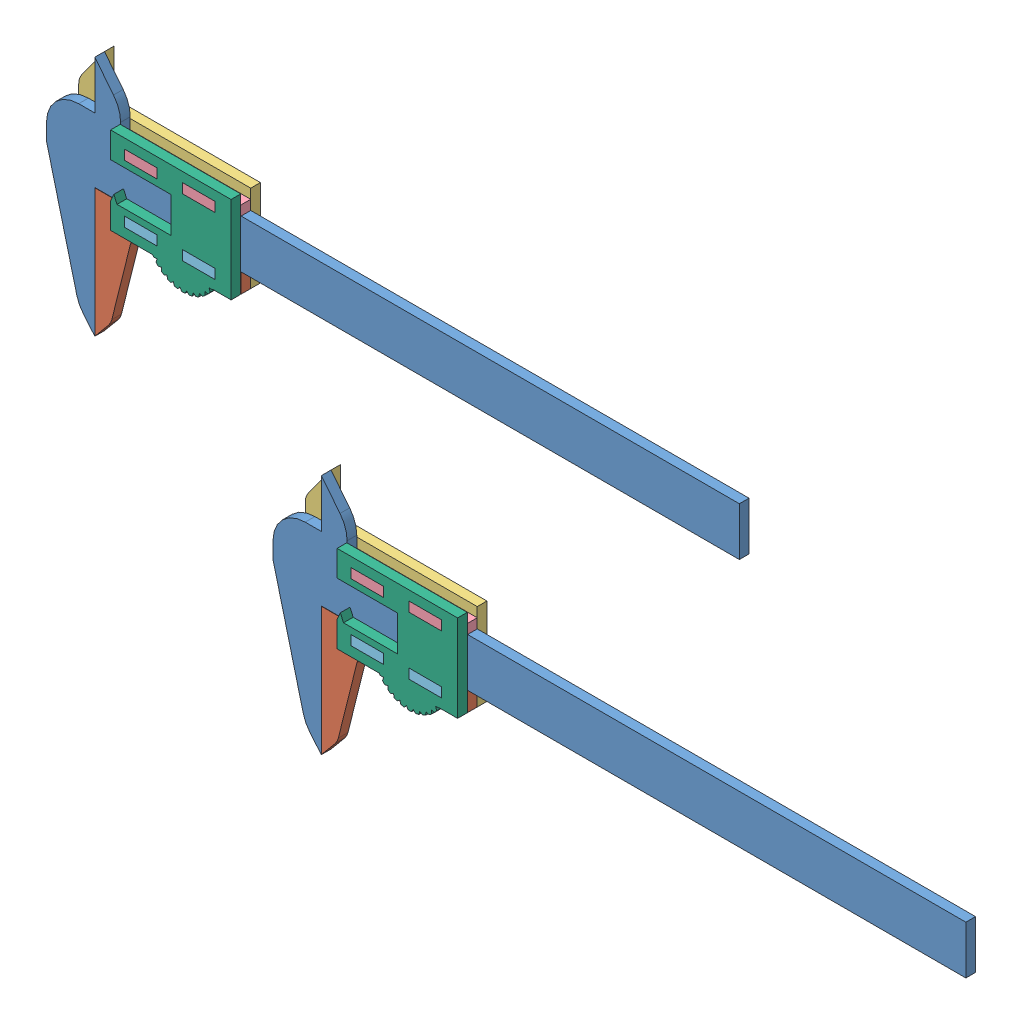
SolidWorks assembly Assemblage1.SLDASM, configuration Défaut (file format 7000). Lengths in mm.
Overall size (218.47 219.12 75.92).
12 component instances, 6 part files, 35 mates.
Components (placement in the parent):
- PIED-1: PIED.SLDPRT [Défaut] at (-102.9276 -4.2937 215) size (215 75 3)
- COULISSE-1: COULISSE.SLDPRT [Défaut] at (-102.9276 -4.2937 215) x (-1 0 0) z (0 0 -1) size (45.38 39.9 3)
- COULISSE 2-1: COULISSE 2.SLDPRT [Défaut] at (-102.9276 -4.2937 215) x (-1 0 0) z (0 0 -1) size (53.37 46.39 3)
- ERGOT-1: ERGOT.SLDPRT [Défaut] at (-102.9276 10.7063 215) x (-1 0 0) z (0 1 0) size (37.38 9.1 3)
- ERGOT2-1: ERGOT2.SLDPRT [Défaut] at (-102.9276 -4.2937 215) x (1 0 0) z (0 -1 0) size (28 9.1 3)
- FENETRE-1: FENETRE.SLDPRT [Défaut] at (-102.9276 10.7063 218.1) x (-1 0 0) z (0 0 1) size (37.38 32.39 3)
- PIED-2: PIED.SLDPRT [Défaut] at (-106.3932 139.8261 281.8181) size (215 75 3)
- FENETRE-2: FENETRE.SLDPRT [Défaut] at (-106.3932 154.8261 284.9181) x (-1 0 0) z (0 0 1) size (37.38 32.39 3)
- COULISSE-2: COULISSE.SLDPRT [Défaut] at (-106.3932 139.8261 281.8181) x (-1 0 0) z (0 0 -1) size (45.38 39.9 3)
- COULISSE 2-2: COULISSE 2.SLDPRT [Défaut] at (-106.3932 139.8261 281.8181) x (-1 0 0) z (0 0 -1) size (53.37 46.39 3)
- ERGOT2-2: ERGOT2.SLDPRT [Défaut] at (-106.3932 139.8261 281.8181) x (1 0 0) z (0 -1 0) size (28 9.1 3)
- ERGOT-3: ERGOT.SLDPRT [Défaut] at (-106.3932 154.8261 281.8181) x (-1 0 0) z (0 1 0) size (37.38 9.1 3)
Mates (geometry in assembly coordinates):
- Sur place1: in place: plane of PIED-1 through (-102.9276 -4.2937 215) normal (0 0 -1); plane of ? through (0 0 215) normal (0 0 -1); moOrthogonalPlaneRef_w of PIED-1 through (-102.9276 -4.2937 215) normal (0 0 -1); unknown of ?; plane of PIED-1 through (-102.9276 -4.2937 215) normal (0 0 -1); plane of ? through (0 0 215) normal (-1 0 0); plane of PIED-1 through (-102.9276 -4.2937 215) normal (0 0 -1); unknown of ?
- Coïncidente1: coincident aligned: plane of PIED-1; plane of COULISSE-1
- Coïncidente2: coincident aligned: moOrthogonalPlaneRef_w of PIED-1 through (-102.9276 -4.2937 215) normal (0 1 0); plane of COULISSE-1
- Coïncidente3: coincident anti-aligned: moOrthogonalPlaneRef_w of PIED-1 through (-102.9276 -4.2937 215) normal (1 0 0); plane of COULISSE-1 through (-102.9276 -4.2937 215) normal (-1 0 0)
- Sur place2: in place: plane of PIED-1 through (-102.9276 -4.2937 215) normal (0 0 -1); plane of ? through (0 0 215) normal (0 0 -1); plane of PIED-1 through (-102.9276 -4.2937 215) normal (0 0 -1); unknown of ?; plane of PIED-1 through (-102.9276 -4.2937 215) normal (0 0 -1); plane of ? through (0 0 215) normal (-1 0 0); plane of PIED-1 through (-102.9276 -4.2937 215) normal (0 0 -1); unknown of ?
- Coïncidente4: coincident aligned: plane of PIED-1; plane of COULISSE 2-1
- Coïncidente5: coincident aligned: moOrthogonalPlaneRef_w of PIED-1 through (-102.9276 -4.2937 215) normal (0 1 0); plane of COULISSE 2-1
- Coïncidente6: coincident anti-aligned: moOrthogonalPlaneRef_w of PIED-1 through (-102.9276 -4.2937 215) normal (1 0 0); plane of COULISSE 2-1 through (-102.9276 -4.2937 215) normal (-1 0 0)
- Sur place3: in place: plane of ? through (-72.249 10.7063 212) normal (0 1 0); plane of ? through (0 10.7063 0) normal (0 1 0); plane of ? through (-72.249 10.7063 212) normal (0 1 0); plane of ? through (0 10.7063 0) normal (0 0 -1); plane of ? through (-72.249 10.7063 212) normal (0 1 0); line of ? through (-55 0 10.7063) axis (0 1 0); plane of ? through (-72.5429 10.7063 212) normal (0 1 0); unknown of ERGOT-1
- Coïncidente7: coincident aligned: plane of COULISSE 2-1; plane of ERGOT-1
- Coïncidente8: coincident aligned: moOrthogonalPlaneRef_w of COULISSE 2-1 through (-102.9276 10.7063 215) normal (0 0 1); plane of ERGOT-1
- Coïncidente9: coincident anti-aligned: moOrthogonalPlaneRef_w of COULISSE 2-1 through (-102.9276 10.7063 215) normal (1 0 0); plane of ERGOT-1
- Sur place4: in place: plane of ? through (-90.7757 -4.2937 212) normal (0 -1 0); plane of ? through (0 -4.2937 0) normal (0 -1 0); plane of ? through (-90.7757 -4.2937 212) normal (0 -1 0); unknown of ?; plane of ? through (-90.7757 -4.2937 212) normal (0 -1 0); line of ? through (-55 0 -4.2937) axis (0 -1 0); plane of ? through (-90.5429 -4.2937 212) normal (0 -1 0); unknown of ERGOT2-1
- Coïncidente10: coincident aligned: plane of COULISSE 2-1; plane of ERGOT2-1
- Coïncidente11: coincident aligned: moOrthogonalPlaneRef_w of COULISSE 2-1 through (-102.9276 -4.2937 215) normal (0 0 1); plane of ERGOT2-1 through (-102.9276 -4.2937 215) normal (0 0 1)
- Coïncidente12: coincident anti-aligned: moOrthogonalPlaneRef_w of COULISSE 2-1 through (-102.9276 -4.2937 215) normal (-1 0 0); plane of ERGOT2-1
- Sur place5: in place: plane of ? through (-80.5429 13.9063 218.3) normal (0 0 1); plane of ? through (0 0 218.3) normal (0 0 1); plane of ? through (-80.5429 13.9063 218.3) normal (0 0 1); plane of ? through (0 0 218.3) normal (0 1 0); plane of ? through (-80.5429 13.9063 218.3) normal (0 0 1); plane of ? through (0 0 218.3) normal (1 0 0); plane of ERGOT-1 through (-80.5429 13.7063 218.1) normal (0 0 1); unknown of FENETRE-1
- Coïncidente13: coincident aligned: plane of ERGOT-1; plane of FENETRE-1
- Coïncidente14: coincident aligned: moOrthogonalPlaneRef_w of ERGOT-1 through (-102.9276 10.7063 218.1) normal (0 -1 0); plane of FENETRE-1
- Coïncidente15: coincident anti-aligned: moOrthogonalPlaneRef_w of ERGOT-1 through (-102.9276 10.7063 218.1) normal (1 0 0); plane of FENETRE-1
- Coïncidente16: coincident anti-aligned: plane of COULISSE 2-2 through (-76.0085 136.8261 278.8181) normal (0 1 0); plane of ERGOT2-2 through (-106.3932 136.8261 281.8181) normal (0 -1 0)
- Coïncidente17: coincident anti-aligned: plane of COULISSE 2-2 through (-66.0085 139.8261 278.8181) normal (-1 0 0); plane of ERGOT2-2 through (-66.0085 136.8261 287.9181) normal (1 0 0)
- Coïncidente18: coincident anti-aligned: plane of COULISSE 2-2 through (-106.3932 139.8261 281.8181) normal (0 0 1); plane of ERGOT2-2 through (-76.0085 136.8261 281.8181) normal (0 0 -1)
- Coïncidente19: coincident anti-aligned: plane of COULISSE-2 through (-106.3932 139.8261 281.8181) normal (0 0 -1); plane of COULISSE 2-2 through (-106.3932 139.8261 281.8181) normal (0 0 1)
- Coïncidente20: coincident anti-aligned: plane of COULISSE-2 through (-94.0085 139.8261 281.8181) normal (1 0 0); plane of ERGOT2-2 through (-94.0085 136.8261 278.8181) normal (-1 0 0)
- Coïncidente21: coincident anti-aligned: plane of COULISSE-2 through (-94.0085 136.8261 281.8181) normal (0 1 0); plane of ERGOT2-2 through (-106.3932 136.8261 281.8181) normal (0 -1 0)
- Coïncidente22: coincident aligned: plane of COULISSE 2-2 through (-106.3932 139.8261 278.8181) normal (0 0 -1); plane of ERGOT-3 through (-66.0085 157.8261 278.8181) normal (0 0 -1)
- Coïncidente23: coincident anti-aligned: plane of COULISSE 2-2 through (-66.0085 157.8261 278.8181) normal (-1 0 0); plane of ERGOT-3 through (-66.0085 157.8261 281.8181) normal (1 0 0)
- Coïncidente24: coincident anti-aligned: plane of COULISSE 2-2 through (-76.0085 154.8261 278.8181) normal (0 1 0); plane of ERGOT-3 through (-106.3932 154.8261 281.8181) normal (0 -1 0)
- Coïncidente25: coincident anti-aligned: plane of FENETRE-2 through (-106.3932 154.8261 284.9181) normal (0 0 -1); plane of ERGOT2-2 through (-84.0085 136.8261 284.9181) normal (0 0 1)
- Coïncidente26: coincident anti-aligned: plane of FENETRE-2 through (-76.0085 136.8261 287.9181) normal (1 0 0); plane of ERGOT2-2 through (-76.0085 136.8261 284.9181) normal (-1 0 0)
- Coïncidente27: coincident anti-aligned: plane of FENETRE-2 through (-66.0085 136.8261 287.9181) normal (0 1 0); plane of ERGOT2-2 through (-106.3932 136.8261 281.8181) normal (0 -1 0)
- Coïncidente28: coincident anti-aligned: plane of PIED-2 through (-106.3932 139.8261 281.8181) normal (0 0 -1); plane of COULISSE 2-2 through (-106.3932 139.8261 281.8181) normal (0 0 1)
- Coïncidente29: coincident anti-aligned: plane of PIED-2 through (-106.3932 139.8261 284.8181) normal (0 -1 0); plane of ERGOT2-2 through (-106.3932 139.8261 281.8181) normal (0 1 0)
- Coïncidente30: coincident anti-aligned: plane of PIED-2 through (-106.3932 99.8261 284.8181) normal (1 0 0); plane of COULISSE-2 through (-106.3932 99.8261 284.8181) normal (-1 0 0)
